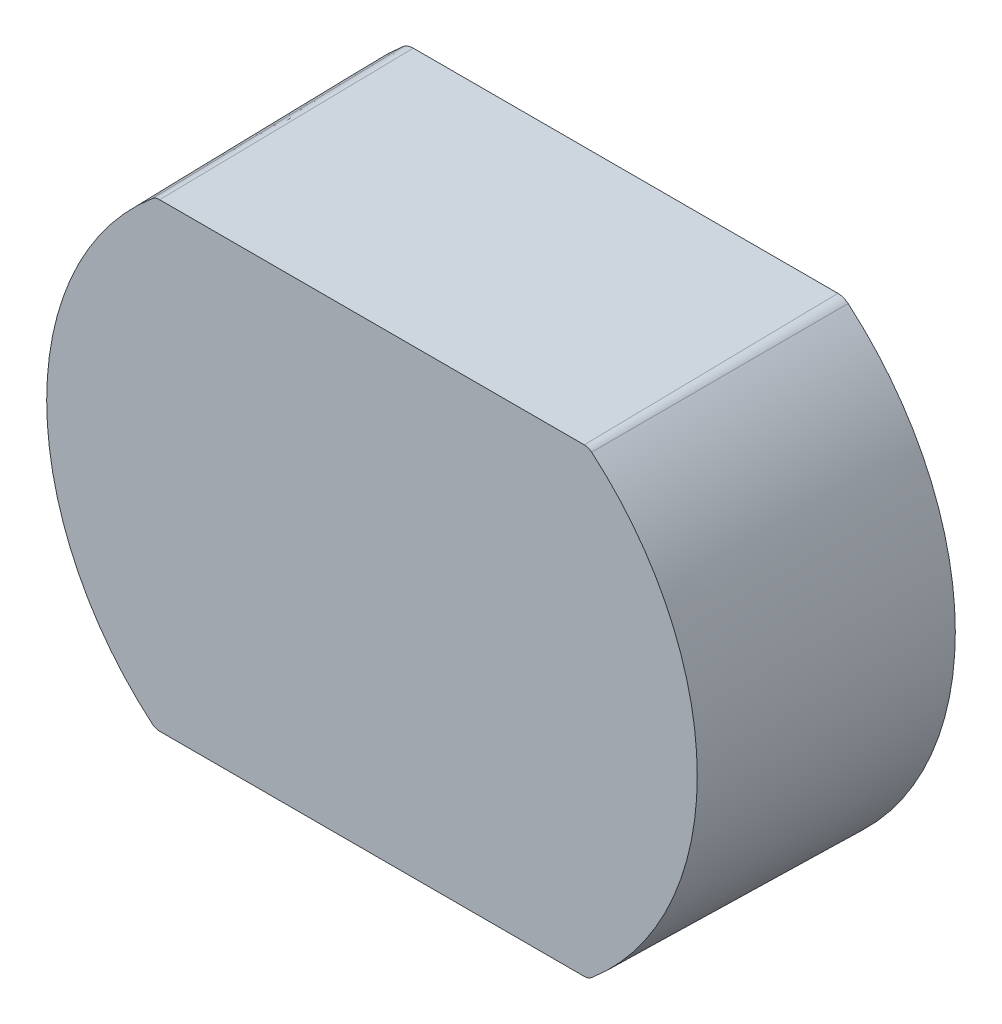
from build123d import *

# Parameters (mm, degrees)
DODANIE_WYCI_GNI_CIE1_DEPTH = 16
DODANIE_WYCI_GNI_CIE1_TAPER = 1


with BuildPart() as part:
    # Szkic1 → Dodanie-wyci_gni_cie1 (new body)
    with BuildSketch(Plane.XY):
        with BuildLine():
            Line((-13.393769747, -14.79999726), (13.393769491, -14.800000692))
            ThreePointArc((13.393769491, -14.800000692), (13.737341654, -14.739116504), (14.039070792, -14.563878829))
            ThreePointArc((14.039070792, -14.563878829), (20.799999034, 0), (14.039070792, 14.563878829))
            ThreePointArc((14.039070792, 14.563878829), (13.737341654, 14.739116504), (13.393769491, 14.800000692))
            Line((13.393769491, 14.800000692), (-13.393769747, 14.79999726))
            ThreePointArc((-13.393769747, 14.79999726), (-13.737341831, 14.739113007), (-14.039070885, 14.563875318))
            ThreePointArc((-14.039070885, 14.563875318), (-20.799996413, 0), (-14.039070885, -14.563875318))
            ThreePointArc((-14.039070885, -14.563875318), (-13.737341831, -14.739113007), (-13.393769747, -14.79999726))
        make_face()
    extrude(amount=DODANIE_WYCI_GNI_CIE1_DEPTH, taper=DODANIE_WYCI_GNI_CIE1_TAPER)


solid = part.part
